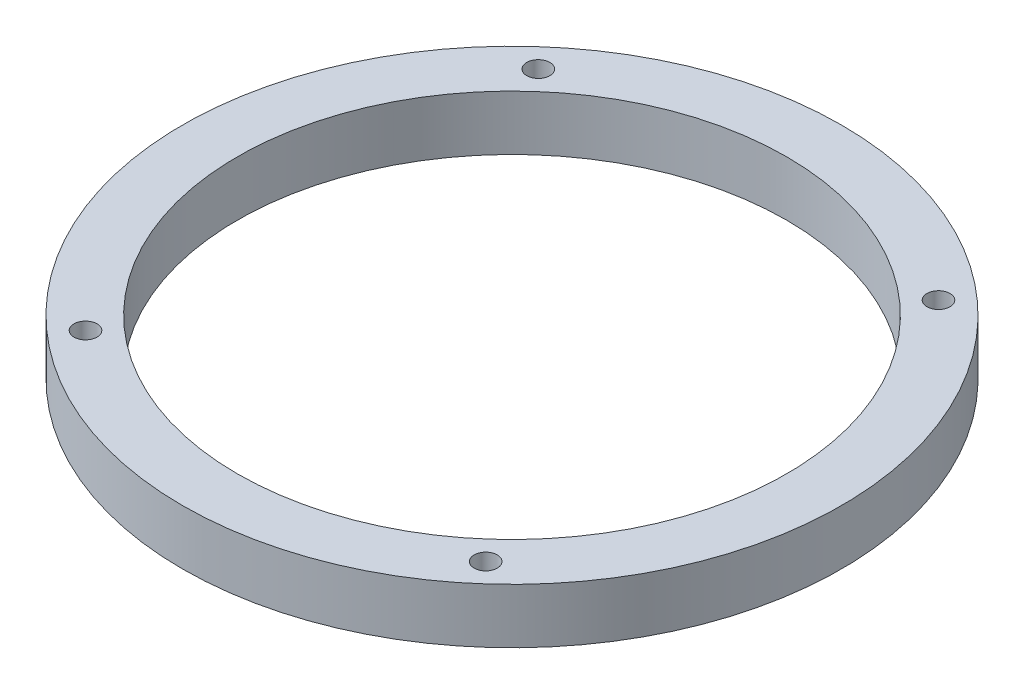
from build123d import *

# Parameters (mm, degrees)
SKETCH1_R           = 60
SKETCH1_R_2         = 50
SKETCH1_R_3         = 2.1
BOSS_EXTRUDE1_DEPTH = 10


with BuildPart() as part:
    # Sketch1 → Boss-Extrude1 (new body)
    with BuildSketch(Plane(origin=(0, 0, 0), x_dir=(1, 0, 0), z_dir=(0, 1, 0))):
        with Locations(Location((0, 0, 0), (0, 0, 270))):
            Circle(SKETCH1_R)
        with Locations(Location((0, 0, 0), (0, 0, 270))):
            Circle(SKETCH1_R_2, mode=Mode.SUBTRACT)
        with Locations(Location((-36.42965754, 41.218014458, 0), (0, 0, 270))):
            Circle(SKETCH1_R_3, mode=Mode.SUBTRACT)
        with Locations(Location((36.42965754, 41.218014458, 0), (0, 0, 270))):
            Circle(SKETCH1_R_3, mode=Mode.SUBTRACT)
        with Locations(Location((-36.42965754, -41.218014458, 0), (0, 0, 270))):
            Circle(SKETCH1_R_3, mode=Mode.SUBTRACT)
        with Locations(Location((36.42965754, -41.218014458, 0), (0, 0, 270))):
            Circle(SKETCH1_R_3, mode=Mode.SUBTRACT)
    extrude(amount=BOSS_EXTRUDE1_DEPTH)


solid = part.part
